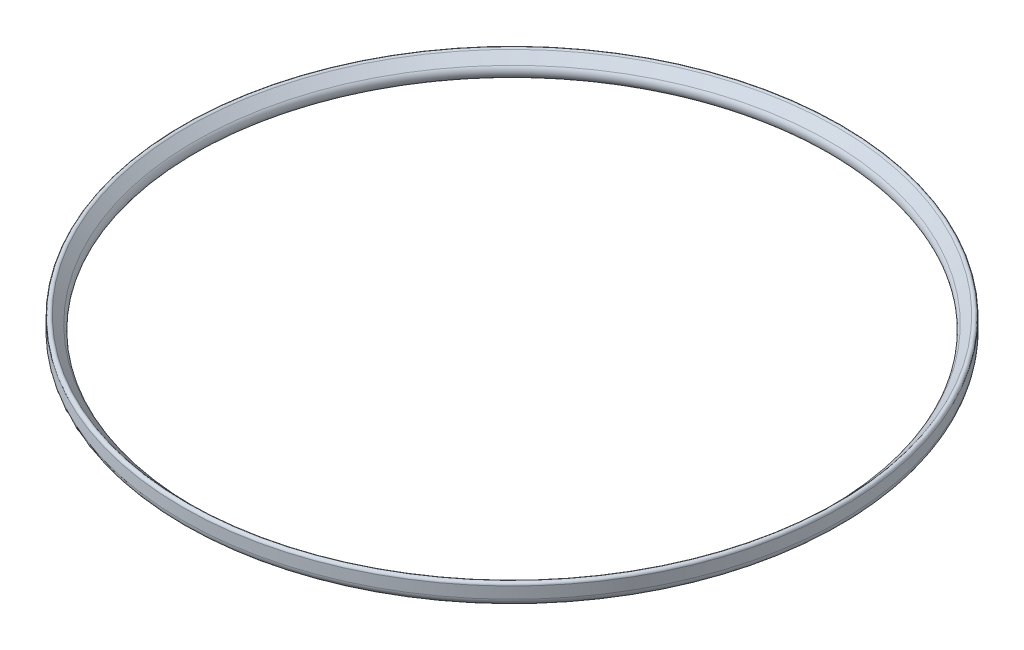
from build123d import *


with BuildPart() as part:
    # Esquisse1 → R_volution1 (revolve)
    with BuildSketch(Plane.XY, mode=Mode.PRIVATE) as r_volution1_sk:
        with BuildLine():
            Line((-63, 3.592893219), (-63, 1.40588745))
            ThreePointArc((-63, 1.40588745), (-61.056102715, 0.10701681), (-60.6, 2.4))
            Line((-60.6, 2.4), (-62.146446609, 3.946446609))
            ThreePointArc((-62.146446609, 3.946446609), (-62.691341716, 4.054832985), (-63, 3.592893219))
        make_face()
    revolve(r_volution1_sk.sketch.rotate(Axis((0, 0, 0), (0, -1, 0)), 270), axis=Axis((0, 0, 0), (0, -1, 0)))


solid = part.part
